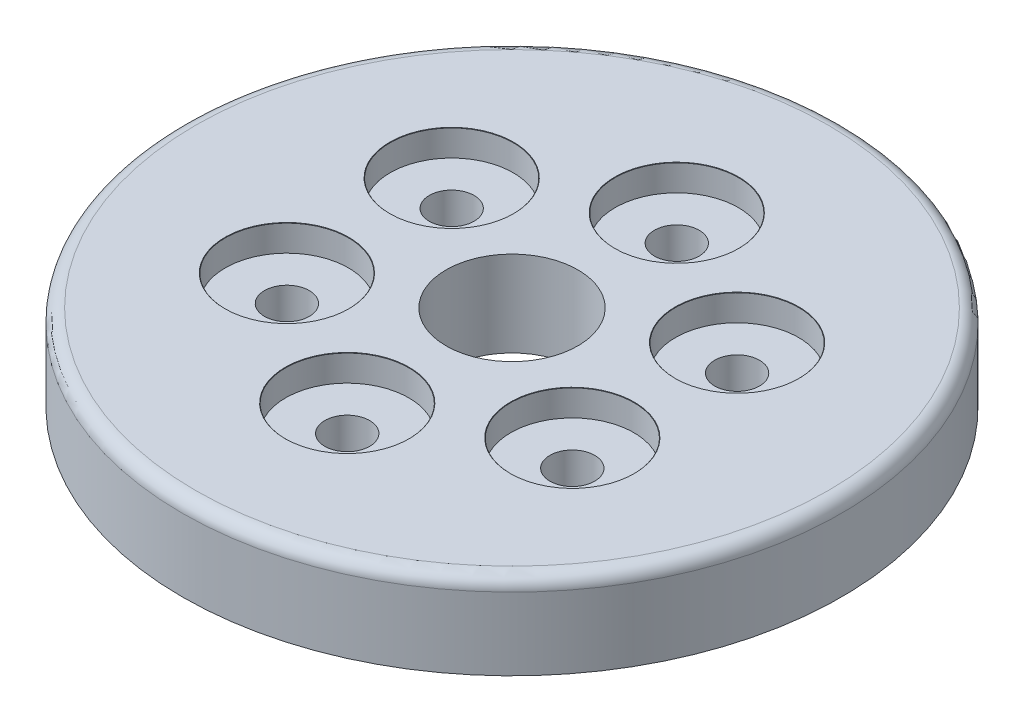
from build123d import *

# Parameters (mm, degrees)
SKETCH1_R                                   = 25
BOSS_EXTRUDE1_DEPTH                         = 6.5
CBORE_FOR_M3_HEX_HEAD_CAP_SCREW1_AT_2_COUNT = 2
CBORE_FOR_M3_HEX_HEAD_CAP_SCREW1_AT_2_PITCH = 12.5
CBORE_FOR_M3_HEX_HEAD_CAP_SCREW1_AT_3_COUNT = 2
CBORE_FOR_M3_HEX_HEAD_CAP_SCREW1_AT_3_PITCH = 21.650635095
CBORE_FOR_M3_HEX_HEAD_CAP_SCREW1_AT_4_COUNT = 2
CBORE_FOR_M3_HEX_HEAD_CAP_SCREW1_AT_4_PITCH = 25
CBORE_FOR_M3_HEX_HEAD_CAP_SCREW1_AT_5_COUNT = 2
CBORE_FOR_M3_HEX_HEAD_CAP_SCREW1_AT_5_PITCH = 21.650635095
CBORE_FOR_M3_HEX_HEAD_CAP_SCREW1_AT_6_COUNT = 2
CBORE_FOR_M3_HEX_HEAD_CAP_SCREW1_AT_6_PITCH = 12.5
FILLET1_R                                   = 1
SKETCH5_R                                   = 5
CUT_EXTRUDE1_DEPTH                          = 20.7


with BuildPart() as part:
    # Sketch1 → Boss-Extrude1 (new body)
    with BuildSketch(Plane(origin=(0, 0, 0), x_dir=(1, 0, 0), z_dir=(0, 1, 0))):
        with Locations(Location((0, 0, 0), (0, 0, 90))):
            Circle(SKETCH1_R)
    extrude(amount=BOSS_EXTRUDE1_DEPTH)

    # Sketch4 → CBORE for M3 Hex Head Cap Screw1 (revolve, cut)
    with BuildSketch(Plane(origin=(-10.825317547, 6.5, -6.25), x_dir=(0, 0, 1), z_dir=(1, 0, 0))):
        Polygon((0, 0), (0, 6.5), (1.7, 6.5), (1.7, 2), (4.6755, 2), (4.6755, 0.025), (4.7005, 0), align=None)
    cbore_for_m3_hex_head_cap_screw1 = revolve(axis=Axis((-10.825317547, 12.85, -6.25), (0, -1, 0)), mode=Mode.SUBTRACT)

    # CBORE for M3 Hex Head Cap Screw1 at 2: CBORE for M3 Hex Head Cap Screw1 ×2
    with Locations(*[Vector(0.8660254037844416, 0, -0.49999999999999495) * (i * CBORE_FOR_M3_HEX_HEAD_CAP_SCREW1_AT_2_PITCH) for i in range(1, CBORE_FOR_M3_HEX_HEAD_CAP_SCREW1_AT_2_COUNT)]):
        add(cbore_for_m3_hex_head_cap_screw1, mode=Mode.SUBTRACT)

    # CBORE for M3 Hex Head Cap Screw1 at 3: CBORE for M3 Hex Head Cap Screw1 ×2
    with Locations(*[(i * CBORE_FOR_M3_HEX_HEAD_CAP_SCREW1_AT_3_PITCH, 0, 0) for i in range(1, CBORE_FOR_M3_HEX_HEAD_CAP_SCREW1_AT_3_COUNT)]):
        add(cbore_for_m3_hex_head_cap_screw1, mode=Mode.SUBTRACT)

    # CBORE for M3 Hex Head Cap Screw1 at 4: CBORE for M3 Hex Head Cap Screw1 ×2
    with Locations(*[Vector(0.8660254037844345, 0, 0.500000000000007) * (i * CBORE_FOR_M3_HEX_HEAD_CAP_SCREW1_AT_4_PITCH) for i in range(1, CBORE_FOR_M3_HEX_HEAD_CAP_SCREW1_AT_4_COUNT)]):
        add(cbore_for_m3_hex_head_cap_screw1, mode=Mode.SUBTRACT)

    # CBORE for M3 Hex Head Cap Screw1 at 5: CBORE for M3 Hex Head Cap Screw1 ×2
    with Locations(*[Vector(0.49999999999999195, 0, 0.8660254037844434) * (i * CBORE_FOR_M3_HEX_HEAD_CAP_SCREW1_AT_5_PITCH) for i in range(1, CBORE_FOR_M3_HEX_HEAD_CAP_SCREW1_AT_5_COUNT)]):
        add(cbore_for_m3_hex_head_cap_screw1, mode=Mode.SUBTRACT)

    # CBORE for M3 Hex Head Cap Screw1 at 6: CBORE for M3 Hex Head Cap Screw1 ×2
    with Locations(*[(0, 0, i * CBORE_FOR_M3_HEX_HEAD_CAP_SCREW1_AT_6_PITCH) for i in range(1, CBORE_FOR_M3_HEX_HEAD_CAP_SCREW1_AT_6_COUNT)]):
        add(cbore_for_m3_hex_head_cap_screw1, mode=Mode.SUBTRACT)

    # Fillet1
    fillet1_edges = [part.edges().sort_by_distance(p)[0] for p in [
        (0, 6.5, 25),
    ]]
    fillet(fillet1_edges, radius=FILLET1_R)

    # Sketch5 → Cut-Extrude1 (cut)
    with BuildSketch(Plane(origin=(0, 6.5, 0), x_dir=(1, 0, 0), z_dir=(0, 1, 0))):
        with Locations(Location((0, 0, 0), (0, 0, 270))):
            Circle(SKETCH5_R)
    extrude(amount=-CUT_EXTRUDE1_DEPTH, mode=Mode.SUBTRACT)


solid = part.part
